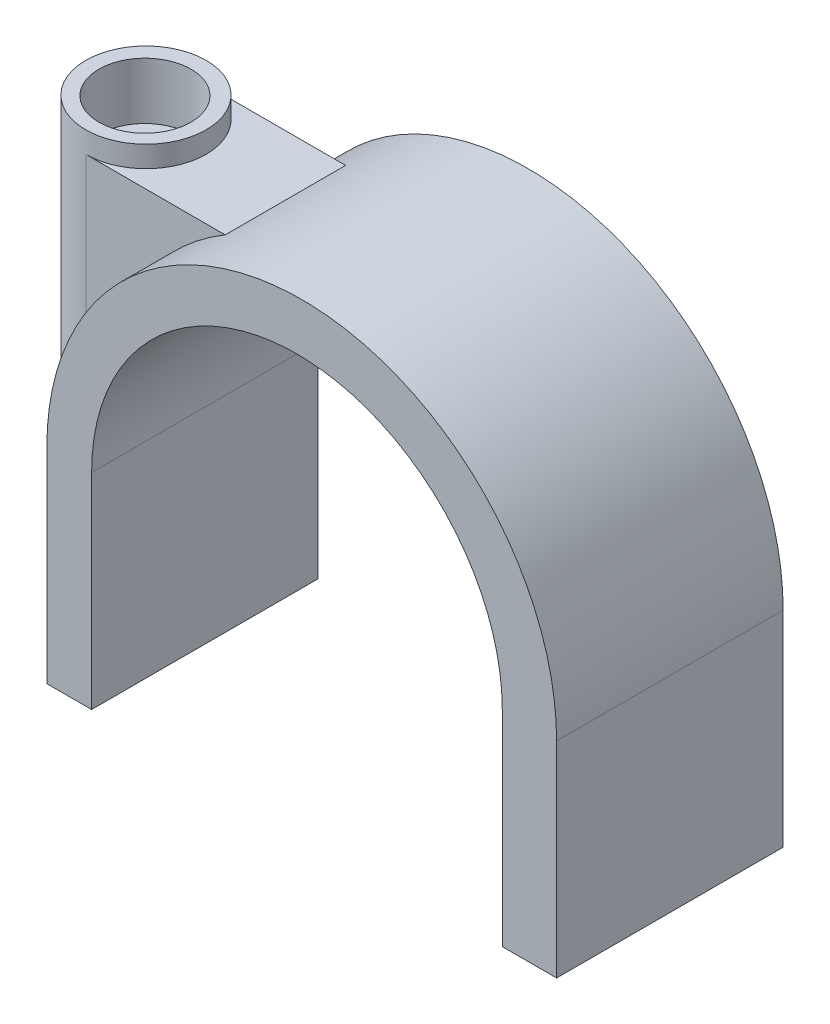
from build123d import *

# Parameters (mm, degrees)
BASE_EXTRUSION_DEPTH    = 16
ESQUISSE2_R             = 4.25
BOSS_EXTRU_1_DEPTH      = 31.5
BOSS_EXTRU_2_REACH      = 53.781
ESQUISSE3_W             = 8.5
ESQUISSE3_H             = 30
ENL_V_MAT_EXTRU_2_DEPTH = 52.071028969
ESQUISSE5_R             = 3.25
ENL_V_MAT_EXTRU_3_DEPTH = 4
ESQUISSE6_R             = 1.25
ENL_V_MAT_EXTRU_4_DEPTH = 49.044250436


with BuildPart() as part:
    # Esquisse1 → Base-Extrusion (new body)
    with BuildSketch(Plane.XY):
        with BuildLine():
            Line((0, 0), (3.5, 0))
            Line((3.5, 0), (32.5, 0))
            Line((32.5, 0), (36, 0))
            Line((36, 0), (36, 14.5))
            ThreePointArc((36, 14.5), (18, 32.5), (0, 14.5))
            Line((0, 14.5), (0, 0))
        make_face()
    extrude(amount=BASE_EXTRUSION_DEPTH)

    # Esquisse2 → Boss.-Extru.1 (add)
    with BuildSketch(Plane.XZ):
        with Locations(Location((-1, 8, 0), (0, 0, 270))):
            Circle(ESQUISSE2_R)
    extrude(amount=-BOSS_EXTRU_1_DEPTH)

    # Esquisse3 → Boss.-Extru.2 (add, up to next)
    with BuildSketch(Plane.ZY.offset(1), mode=Mode.PRIVATE) as boss_extru_2_sk1:
        with Locations((8, 15)):
            Rectangle(ESQUISSE3_W, ESQUISSE3_H)
    boss_extru_2_tool1 = extrude(boss_extru_2_sk1.sketch, amount=-BOSS_EXTRU_2_REACH, mode=Mode.PRIVATE) - part.part
    add(boss_extru_2_tool1.solids().sort_by_distance((-1, 15, 8))[0])

    # Esquisse4 → Enl_v. mat.-Extru.2 (cut, through all)
    with BuildSketch(Plane.XY):
        with BuildLine():
            Line((32.162581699, 14.5), (32.162581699, 0))
            Line((32.162581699, 0), (3.162581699, 0))
            Line((3.162581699, 0), (3.162581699, 14.5))
            ThreePointArc((3.162581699, 14.5), (17.662581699, 29), (32.162581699, 14.5))
        make_face()
    extrude(amount=ENL_V_MAT_EXTRU_2_DEPTH, mode=Mode.SUBTRACT)

    # Esquisse5 → Enl_v. mat.-Extru.3 (cut)
    with BuildSketch(Plane(origin=(0, 31.5, 0), x_dir=(-1, 0, 0), z_dir=(0, 1, 0))):
        with Locations(Location((1, 8.073056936, 0), (0, 0, 90))):
            Circle(ESQUISSE5_R)
    extrude(amount=-ENL_V_MAT_EXTRU_3_DEPTH, mode=Mode.SUBTRACT)

    # Esquisse6 → Enl_v. mat.-Extru.4 (cut, through all)
    with BuildSketch(Plane(origin=(0, 27.5, 0), x_dir=(-1, 0, 0), z_dir=(0, 1, 0))):
        with Locations(Location((1, 8, 0), (0, 0, 90))):
            Circle(ESQUISSE6_R)
    extrude(amount=-ENL_V_MAT_EXTRU_4_DEPTH, mode=Mode.SUBTRACT)


solid = part.part
